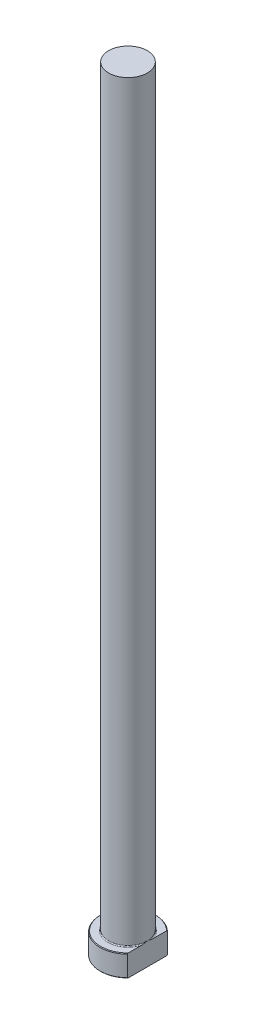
from build123d import *
from build123d.topology import SkipClean

# Parameters (mm, degrees)
CHAMFER1_SIZE = 0.2
FILLET1_R     = 0.3
KEY_DEPTH     = 251.32379032


with BuildPart() as part:
    # Sketch1 → Revolve1 (revolve)
    with BuildSketch(Plane.XY, mode=Mode.PRIVATE) as revolve1_sk:
        Polygon((0, 0), (-9, 0), (-9, 7), (-6.25, 7), (-6.25, 250), (0, 250), align=None)
    revolve(revolve1_sk.sketch.rotate(Axis((0, 259.958771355, 0), (0, -1, 0)), 270), axis=Axis((0, 259.958771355, 0), (0, -1, 0)))

    # Chamfer1
    chamfer1_edges = [part.edges().sort_by_distance(p)[0] for p in [
        (0, 7, -9),
        (0, 0, -9),
    ]]
    chamfer(chamfer1_edges, length=CHAMFER1_SIZE)

    # Fillet1
    fillet1_edges = [part.edges().sort_by_distance(p)[0] for p in [
        (0, 7, -6.25),
    ]]
    fillet(fillet1_edges, radius=FILLET1_R)

    # Sketch2 → KEY (cut, through all)
    with SkipClean():  # the faces are left unmerged after this step: merging them gives an invalid solid
        with BuildSketch(Plane(origin=(0, 0, 0), x_dir=(1, 0, 0), z_dir=(0, 1, 0))):
            with BuildLine():
                Line((6.25, 6.475916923), (6.25, -6.475916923))
                ThreePointArc((6.25, -6.475916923), (9, 0), (6.25, 6.475916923))
            make_face()
        extrude(amount=KEY_DEPTH, mode=Mode.SUBTRACT)


solid = part.part
